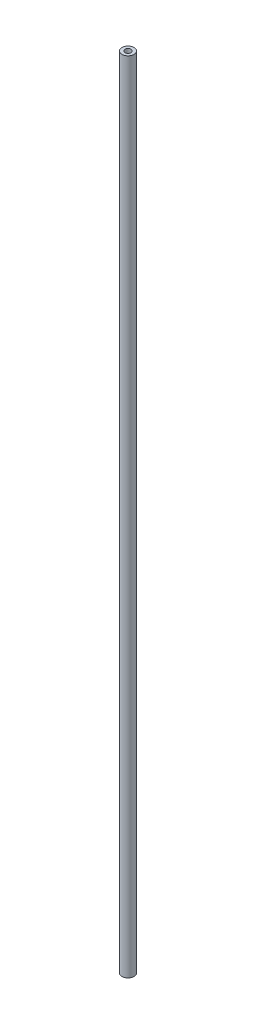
from build123d import *

# Parameters (mm, degrees)
SKETCH1_R           = 6.35
SKETCH1_R_2         = 3.175
BOSS_EXTRUDE1_DEPTH = 842.01


with BuildPart() as part:
    # Sketch1 → Boss-Extrude1 (new body)
    with BuildSketch(Plane(origin=(0, 0, 0), x_dir=(1, 0, 0), z_dir=(0, 1, 0))):
        with Locations(Location((0, 0, 0), (0, 0, 180))):
            Circle(SKETCH1_R)
        with Locations(Location((0, 0, 0), (0, 0, 180))):
            Circle(SKETCH1_R_2, mode=Mode.SUBTRACT)
    extrude(amount=BOSS_EXTRUDE1_DEPTH)


solid = part.part
